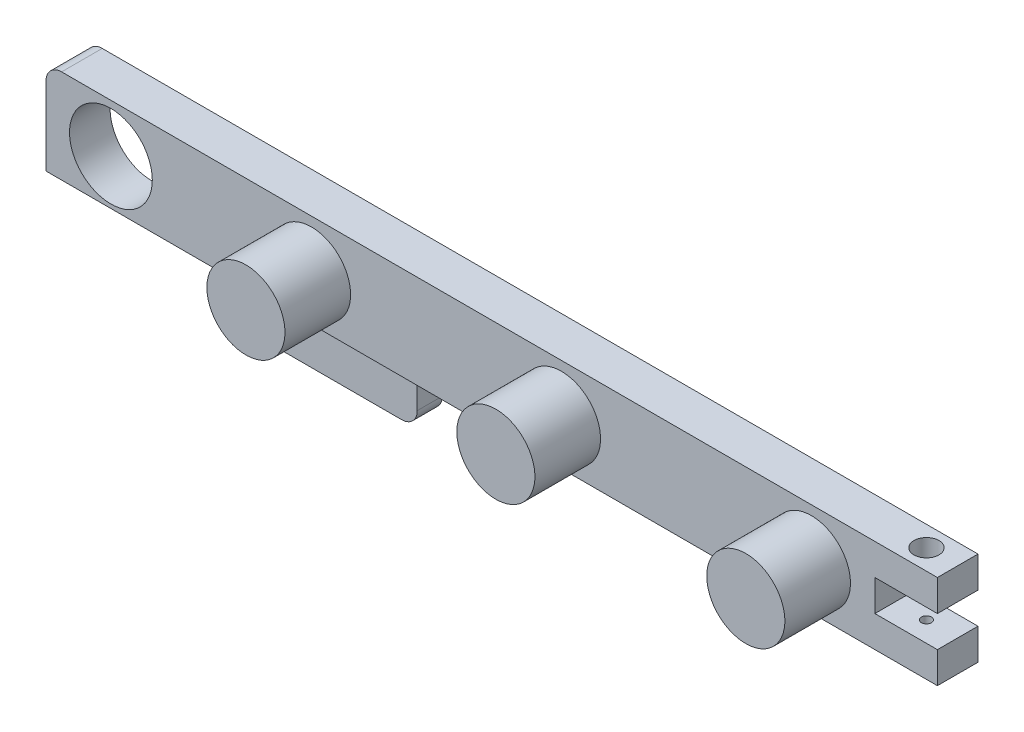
from build123d import *

# Parameters (mm, degrees)
SKETCH1_W           = 355.325
SKETCH1_H           = 30
SKETCH1_R           = 12.5
SKETCH1_R_2         = 1
SKETCH1_W_2         = 50
SKETCH1_H_2         = 5
BOSS_EXTRUDE3_DEPTH = 13
FILLET3_R           = 5
SKETCH3_R           = 12.5
BOSS_EXTRUDE4_DEPTH = 13
CUT_EXTRUDE1_REACH  = 359.536
SKETCH4_R           = 1.425
SKETCH5_W           = 63.83
SKETCH5_H           = 18
CUT_EXTRUDE3_DEPTH  = 358.535810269
FILLET4_R           = 5
SKETCH6_W           = 63.8325
SKETCH6_H           = 17
CUT_EXTRUDE4_DEPTH  = 5
SKETCH7_R           = 2.159563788
SKETCH7_R_2         = 1
SKETCH7_R_3         = 2.117135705
SKETCH7_R_4         = 1.916104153
SKETCH7_R_5         = 2.415941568
BOSS_EXTRUDE5_DEPTH = 8
SKETCH8_R           = 12.5
BOSS_EXTRUDE6_DEPTH = 13
SKETCH10_W          = 20
SKETCH10_H          = 10
SKETCH10_R          = 12.5
CUT_EXTRUDE6_DEPTH  = 358.535810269
SKETCH11_R          = 13.25
CUT_EXTRUDE7_DEPTH  = 289.073524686
SKETCH12_R          = 1.25
CUT_EXTRUDE8_DEPTH  = 289.567766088
SKETCH15_R          = 1.6
CUT_EXTRUDE10_DEPTH = 292.788203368
SKETCH17_R          = 4
CUT_EXTRUDE11_DEPTH = 7.5
SKETCH18_R          = 4.25
CUT_EXTRUDE12_DEPTH = 7.5
SKETCH19_W          = 52.537451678
SKETCH19_H          = 17.901984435
CUT_EXTRUDE13_DEPTH = 5
CUT_EXTRUDE14_START = -5
SKETCH20_R          = 12.5
CUT_EXTRUDE14_DEPTH = 5


with BuildPart() as part:
    # Sketch1 → Boss-Extrude3 (new body)
    # profile 1 of 3: a face of its own
    with BuildSketch(Plane.XY):
        with Locations((177.6625, 15)):
            Rectangle(SKETCH1_W, SKETCH1_H)
        with Locations(Location((334.55, 14.5, 0), (0, 0, 180))):
            Circle(SKETCH1_R, mode=Mode.SUBTRACT)
        with Locations(Location((20.775, 14.5, 0), (0, 0, 180))):
            Circle(SKETCH1_R, mode=Mode.SUBTRACT)
    # profile 2 of 3: a face of its own
    with BuildSketch(Plane.XY):
        Polygon((177.6625, 0), (50, 0), (50, -5), (50, -17), (177.6625, -17), align=None)
        with Locations(Location((60, -14.5, 0), (0, 0, 180))):
            Circle(SKETCH1_R_2, mode=Mode.SUBTRACT)
        with Locations(Location((68, -14.5, 0), (0, 0, 180))):
            Circle(SKETCH1_R_2, mode=Mode.SUBTRACT)
        with Locations(Location((60, -2.5, 0), (0, 0, 180))):
            Circle(SKETCH1_R_2, mode=Mode.SUBTRACT)
        with Locations(Location((68, -2.5, 0), (0, 0, 180))):
            Circle(SKETCH1_R_2, mode=Mode.SUBTRACT)
    # profile 3 of 3: a face of its own
    with BuildSketch(Plane.XY):
        with Locations((25, -2.5)):
            Rectangle(SKETCH1_W_2, SKETCH1_H_2)
    extrude(amount=BOSS_EXTRUDE3_DEPTH)

    # Fillet3
    fillet3_edges = [part.edges().sort_by_distance(p)[0] for p in [
        (0, -5, 6.5),
        (0, 30, 6.5),
        (355.325, 30, 6.5),
        (355.325, 0, 6.5),
        (177.6625, -17, 6.5),
        (50, -17, 6.5),
    ]]
    fillet(fillet3_edges, radius=FILLET3_R)

    # Sketch3 → Boss-Extrude4 (add)
    with BuildSketch(Plane.XY.offset(13)):
        with Locations(Location((85, 14.5, 0), (0, 0, 180))):
            Circle(SKETCH3_R)
        with Locations(Location((165, 14.5, 0), (0, 0, 180))):
            Circle(SKETCH3_R)
        with Locations(Location((245, 14.5, 0), (0, 0, 180))):
            Circle(SKETCH3_R)
    extrude(amount=BOSS_EXTRUDE4_DEPTH)

    # Sketch4 → Cut-Extrude1 (cut, up to next)
    with BuildSketch(Plane(origin=(0, 0, 0), x_dir=(-1, 0, 0), z_dir=(0, 0, -1)), mode=Mode.PRIVATE) as cut_extrude1_sk1:
        with Locations((-68, -2.5)):
            Circle(SKETCH4_R)
    cut_extrude1_tool1 = extrude(cut_extrude1_sk1.sketch, amount=-CUT_EXTRUDE1_REACH, mode=Mode.PRIVATE) & part.part
    # Sketch4 → Cut-Extrude1 (cut, up to next)
    with BuildSketch(Plane(origin=(0, 0, 0), x_dir=(-1, 0, 0), z_dir=(0, 0, -1)), mode=Mode.PRIVATE) as cut_extrude1_sk2:
        with Locations((-60, -2.5)):
            Circle(SKETCH4_R)
    cut_extrude1_tool2 = extrude(cut_extrude1_sk2.sketch, amount=-CUT_EXTRUDE1_REACH, mode=Mode.PRIVATE) & part.part
    # Sketch4 → Cut-Extrude1 (cut, up to next)
    with BuildSketch(Plane(origin=(0, 0, 0), x_dir=(-1, 0, 0), z_dir=(0, 0, -1)), mode=Mode.PRIVATE) as cut_extrude1_sk3:
        with Locations((-60, -14.5)):
            Circle(SKETCH4_R)
    cut_extrude1_tool3 = extrude(cut_extrude1_sk3.sketch, amount=-CUT_EXTRUDE1_REACH, mode=Mode.PRIVATE) & part.part
    # Sketch4 → Cut-Extrude1 (cut, up to next)
    with BuildSketch(Plane(origin=(0, 0, 0), x_dir=(-1, 0, 0), z_dir=(0, 0, -1)), mode=Mode.PRIVATE) as cut_extrude1_sk4:
        with Locations((-68, -14.5)):
            Circle(SKETCH4_R)
    cut_extrude1_tool4 = extrude(cut_extrude1_sk4.sketch, amount=-CUT_EXTRUDE1_REACH, mode=Mode.PRIVATE) & part.part
    add(cut_extrude1_tool1.solids().sort_by_distance((68, -2.5, 0))[0], mode=Mode.SUBTRACT)
    add(cut_extrude1_tool2.solids().sort_by_distance((60, -2.5, 0))[0], mode=Mode.SUBTRACT)
    add(cut_extrude1_tool3.solids().sort_by_distance((60, -14.5, 0))[0], mode=Mode.SUBTRACT)
    add(cut_extrude1_tool4.solids().sort_by_distance((68, -14.5, 0))[0], mode=Mode.SUBTRACT)

    # Sketch5 → Cut-Extrude3 (cut, through all)
    with BuildSketch(Plane(origin=(0, 0, 0), x_dir=(-1, 0, 0), z_dir=(0, 0, -1))):
        with Locations((-145.7475, -9)):
            Rectangle(SKETCH5_W, SKETCH5_H)
    extrude(amount=-CUT_EXTRUDE3_DEPTH, mode=Mode.SUBTRACT)

    # Fillet4
    fillet4_edges = [part.edges().sort_by_distance(p)[0] for p in [
        (113.8325, -17, 6.5),
    ]]
    fillet(fillet4_edges, radius=FILLET4_R)

    # Sketch6 → Cut-Extrude4 (cut)
    with BuildSketch(Plane.XY.offset(13)):
        with Locations((81.91625, -8.5)):
            Rectangle(SKETCH6_W, SKETCH6_H)
    extrude(amount=-CUT_EXTRUDE4_DEPTH, mode=Mode.SUBTRACT)

    # Sketch7 → Boss-Extrude5 (add)
    # profile 1 of 4: a face of its own
    with BuildSketch(Plane.XY.offset(8)):
        with Locations((60, -14.5)):
            Circle(SKETCH7_R)
        with Locations((60, -14.5)):
            Circle(SKETCH7_R_2, mode=Mode.SUBTRACT)
    # profile 2 of 4: a face of its own
    with BuildSketch(Plane.XY.offset(8)):
        with Locations((60, -2.5)):
            Circle(SKETCH7_R_3)
        with Locations((60, -2.5)):
            Circle(SKETCH7_R_2, mode=Mode.SUBTRACT)
    # profile 3 of 4: a face of its own
    with BuildSketch(Plane.XY.offset(8)):
        with Locations((68, -2.5)):
            Circle(SKETCH7_R_4)
        with Locations((68, -2.5)):
            Circle(SKETCH7_R_2, mode=Mode.SUBTRACT)
    # profile 4 of 4: a face of its own
    with BuildSketch(Plane.XY.offset(8)):
        with Locations((68, -14.5)):
            Circle(SKETCH7_R_5)
        with Locations((68, -14.5)):
            Circle(SKETCH7_R_2, mode=Mode.SUBTRACT)
    extrude(amount=-BOSS_EXTRUDE5_DEPTH)

    # Sketch8 → Boss-Extrude6 (add)
    with BuildSketch(Plane.XY.offset(26)):
        with Locations(Location((85, 14.5, 0), (0, 0, 180))):
            Circle(SKETCH8_R)
        with Locations(Location((165, 14.5, 0), (0, 0, 180))):
            Circle(SKETCH8_R)
        with Locations(Location((245, 14.5, 0), (0, 0, 180))):
            Circle(SKETCH8_R)
    extrude(amount=BOSS_EXTRUDE6_DEPTH)

    # Sketch10 → Cut-Extrude6 (cut, through all)
    # profile 1 of 2: a face of its own
    with BuildSketch(Plane.XY.offset(13)):
        with Locations((275.325, 15)):
            Rectangle(SKETCH10_W, SKETCH10_H)
    # profile 2 of 2: a face of its own
    with BuildSketch(Plane.XY.offset(13)):
        with BuildLine():
            ThreePointArc((355.325, 25), (353.860533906, 28.535533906), (350.325, 30))
            Line((350.325, 30), (285.325, 30))
            Line((285.325, 30), (285.325, 20))
            Line((285.325, 20), (285.325, 10))
            Line((285.325, 10), (285.325, 0))
            Line((285.325, 0), (350.325, 0))
            ThreePointArc((350.325, 0), (353.860533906, 1.464466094), (355.325, 5))
            Line((355.325, 5), (355.325, 25))
        make_face()
        with Locations((334.55, 14.5)):
            Circle(SKETCH10_R, mode=Mode.SUBTRACT)
    extrude(amount=-CUT_EXTRUDE6_DEPTH, mode=Mode.SUBTRACT)

    # Sketch11 → Cut-Extrude7 (cut, through all)
    with BuildSketch(Plane.XY.offset(13)):
        with Locations((20.775, 14.5)):
            Circle(SKETCH11_R)
    extrude(amount=-CUT_EXTRUDE7_DEPTH, mode=Mode.SUBTRACT)

    # Sketch12 → Cut-Extrude8 (cut, through all)
    with BuildSketch(Plane.XY.offset(8)):
        with Locations((60, -2.5)):
            Circle(SKETCH12_R)
        with Locations((68, -2.5)):
            Circle(SKETCH12_R)
        with Locations((68, -14.5)):
            Circle(SKETCH12_R)
        with Locations((60, -14.5)):
            Circle(SKETCH12_R)
    extrude(amount=-CUT_EXTRUDE8_DEPTH, mode=Mode.SUBTRACT)

    # Sketch15 → Cut-Extrude10 (cut, through all)
    with BuildSketch(Plane(origin=(0, 30, 0), x_dir=(1, 0, 0), z_dir=(0, 1, 0))):
        with Locations(Location((275.325, -6.5, 0), (0, 0, 180))):
            Circle(SKETCH15_R)
    extrude(amount=-CUT_EXTRUDE10_DEPTH, mode=Mode.SUBTRACT)

    # Sketch17 → Cut-Extrude11 (cut)
    with BuildSketch(Plane(origin=(0, 30, 0), x_dir=(1, 0, 0), z_dir=(0, 1, 0))):
        with Locations(Location((275.325, -6.5, 0), (0, 0, 180))):
            Circle(SKETCH17_R)
    extrude(amount=-CUT_EXTRUDE11_DEPTH, mode=Mode.SUBTRACT)

    # Sketch18 → Cut-Extrude12 (cut)
    with BuildSketch(Plane.XZ):
        with Locations(Location((275.325, 6.5, 0), (0, 0, 270))):
            Circle(SKETCH18_R)
    extrude(amount=-CUT_EXTRUDE12_DEPTH, mode=Mode.SUBTRACT)

    # Sketch19 → Cut-Extrude13 (cut)
    with BuildSketch(Plane.XY.offset(13)):
        with Locations((23.731274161, -8.950992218)):
            Rectangle(SKETCH19_W, SKETCH19_H)
    extrude(amount=-CUT_EXTRUDE13_DEPTH, mode=Mode.SUBTRACT)

    # Sketch20 → Cut-Extrude14 (cut)
    with BuildSketch(Plane.XY.offset(39).offset(CUT_EXTRUDE14_START)):
        with Locations(Location((85, 14.5, 0), (0, 0, 180))):
            Circle(SKETCH20_R)
        with Locations(Location((165, 14.5, 0), (0, 0, 180))):
            Circle(SKETCH20_R)
        with Locations(Location((245, 14.5, 0), (0, 0, 180))):
            Circle(SKETCH20_R)
    extrude(amount=CUT_EXTRUDE14_DEPTH, mode=Mode.SUBTRACT)


solid = part.part
